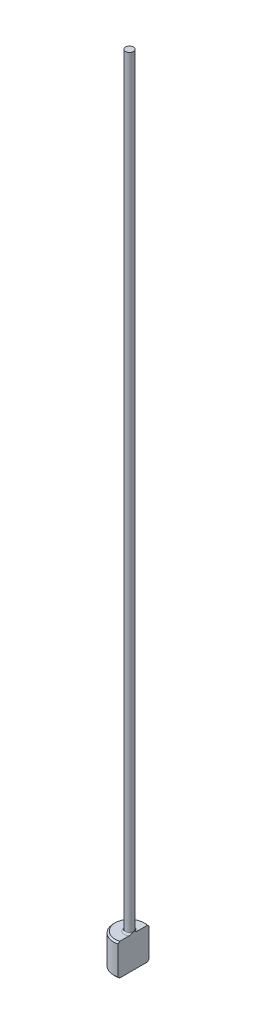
ISO-10303-21;
HEADER;
FILE_DESCRIPTION(('STEP AP214'),'2;1');
FILE_NAME('part.step','',(''),(''),'','','');
FILE_SCHEMA(('AUTOMOTIVE_DESIGN { 1 0 10303 214 1 1 1 1 }'));
ENDSEC;
DATA;
#1=APPLICATION_CONTEXT('core data for automotive mechanical design processes');
#2=APPLICATION_PROTOCOL_DEFINITION('international standard','automotive_design',2000,#1);
#3=PRODUCT_CONTEXT('',#1,'mechanical');
#4=PRODUCT('Part','Part','',(#3));
#5=PRODUCT_RELATED_PRODUCT_CATEGORY('part','',(#4));
#6=PRODUCT_DEFINITION_FORMATION('','',#4);
#7=PRODUCT_DEFINITION_CONTEXT('part definition',#1,'design');
#8=PRODUCT_DEFINITION('design','',#6,#7);
#9=PRODUCT_DEFINITION_SHAPE('','',#8);
#10=(LENGTH_UNIT() NAMED_UNIT(*) SI_UNIT(.MILLI.,.METRE.));
#11=(NAMED_UNIT(*) PLANE_ANGLE_UNIT() SI_UNIT($,.RADIAN.));
#12=(NAMED_UNIT(*) SI_UNIT($,.STERADIAN.) SOLID_ANGLE_UNIT());
#13=UNCERTAINTY_MEASURE_WITH_UNIT(LENGTH_MEASURE(1.E-05),#10,'distance_accuracy_value','');
#14=(GEOMETRIC_REPRESENTATION_CONTEXT(3) GLOBAL_UNCERTAINTY_ASSIGNED_CONTEXT((#13)) GLOBAL_UNIT_ASSIGNED_CONTEXT((#10,
#11,#12)) REPRESENTATION_CONTEXT('',''));
#15=CARTESIAN_POINT('',(0.,0.,0.));
#16=DIRECTION('',(0.,0.,1.));
#17=DIRECTION('',(1.,0.,0.));
#18=AXIS2_PLACEMENT_3D('',#15,#16,#17);
#19=CARTESIAN_POINT('',(0.,0.,0.));
#20=DIRECTION('',(0.,-1.,0.));
#21=DIRECTION('',(0.,0.,-1.));
#22=AXIS2_PLACEMENT_3D('',#19,#20,#21);
#23=PLANE('',#22);
#24=CARTESIAN_POINT('',(0.,0.,0.));
#25=DIRECTION('',(0.,-1.,0.));
#26=DIRECTION('',(0.,0.,-1.));
#27=AXIS2_PLACEMENT_3D('',#24,#25,#26);
#28=CIRCLE('',#27,1.79999999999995);
#29=CARTESIAN_POINT('',(0.499999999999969,0.,1.72916164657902));
#30=VERTEX_POINT('',#29);
#31=CARTESIAN_POINT('',(0.499999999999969,0.,-1.72916164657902));
#32=VERTEX_POINT('',#31);
#33=EDGE_CURVE('E98',#30,#32,#28,.T.);
#34=ORIENTED_EDGE('',*,*,#33,.T.);
#35=DIRECTION('',(0.,0.,1.));
#36=VECTOR('',#35,1.);
#37=CARTESIAN_POINT('',(0.499999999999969,0.,1.93649167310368));
#38=LINE('',#37,#36);
#39=EDGE_CURVE('E83',#32,#30,#38,.T.);
#40=ORIENTED_EDGE('',*,*,#39,.T.);
#41=EDGE_LOOP('',(#34,#40));
#42=FACE_BOUND('',#41,.T.);
#43=ADVANCED_FACE('F32',(#42),#23,.T.);
#44=CARTESIAN_POINT('',(0.,259.958771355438,0.));
#45=DIRECTION('',(0.,1.,0.));
#46=DIRECTION('',(0.,0.,1.));
#47=AXIS2_PLACEMENT_3D('',#44,#45,#46);
#48=CYLINDRICAL_SURFACE('',#47,1.99999999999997);
#49=CARTESIAN_POINT('',(0.,3.80000000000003,0.));
#50=DIRECTION('',(0.,1.,0.));
#51=DIRECTION('',(0.,0.,1.));
#52=AXIS2_PLACEMENT_3D('',#49,#50,#51);
#53=CIRCLE('',#52,1.99999999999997);
#54=CARTESIAN_POINT('',(0.499999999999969,3.80000000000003,1.93649167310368));
#55=VERTEX_POINT('',#54);
#56=CARTESIAN_POINT('',(0.499999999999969,3.80000000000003,-1.93649167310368));
#57=VERTEX_POINT('',#56);
#58=EDGE_CURVE('E104',#55,#57,#53,.F.);
#59=ORIENTED_EDGE('',*,*,#58,.T.);
#60=DIRECTION('',(0.,-1.,0.));
#61=VECTOR('',#60,1.);
#62=CARTESIAN_POINT('',(0.499999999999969,100.,-1.93649167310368));
#63=LINE('',#62,#61);
#64=CARTESIAN_POINT('',(0.499999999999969,0.200000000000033,-1.93649167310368));
#65=VERTEX_POINT('',#64);
#66=EDGE_CURVE('E183',#57,#65,#63,.T.);
#67=ORIENTED_EDGE('',*,*,#66,.T.);
#68=CARTESIAN_POINT('',(0.,0.200000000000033,0.));
#69=DIRECTION('',(0.,-1.,0.));
#70=DIRECTION('',(0.,0.,-1.));
#71=AXIS2_PLACEMENT_3D('',#68,#69,#70);
#72=CIRCLE('',#71,1.99999999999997);
#73=CARTESIAN_POINT('',(0.499999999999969,0.200000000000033,1.93649167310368));
#74=VERTEX_POINT('',#73);
#75=EDGE_CURVE('E100',#65,#74,#72,.F.);
#76=ORIENTED_EDGE('',*,*,#75,.T.);
#77=DIRECTION('',(0.,-1.,0.));
#78=VECTOR('',#77,1.);
#79=CARTESIAN_POINT('',(0.499999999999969,100.,1.93649167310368));
#80=LINE('',#79,#78);
#81=EDGE_CURVE('E93',#55,#74,#80,.T.);
#82=ORIENTED_EDGE('',*,*,#81,.F.);
#83=EDGE_LOOP('',(#59,#67,#76,#82));
#84=FACE_BOUND('',#83,.T.);
#85=ADVANCED_FACE('F158',(#84),#48,.T.);
#86=CARTESIAN_POINT('',(-1.99999999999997,4.,0.));
#87=DIRECTION('',(0.,1.,0.));
#88=DIRECTION('',(0.,0.,1.));
#89=AXIS2_PLACEMENT_3D('',#86,#87,#88);
#90=PLANE('',#89);
#91=CARTESIAN_POINT('',(0.,4.,0.));
#92=DIRECTION('',(0.,1.,0.));
#93=DIRECTION('',(0.,0.,1.));
#94=AXIS2_PLACEMENT_3D('',#91,#92,#93);
#95=CIRCLE('',#94,1.8);
#96=CARTESIAN_POINT('',(0.499999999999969,4.,-1.72916164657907));
#97=VERTEX_POINT('',#96);
#98=CARTESIAN_POINT('',(0.499999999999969,4.,1.72916164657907));
#99=VERTEX_POINT('',#98);
#100=EDGE_CURVE('E178',#97,#99,#95,.T.);
#101=ORIENTED_EDGE('',*,*,#100,.T.);
#102=DIRECTION('',(0.,0.,-1.));
#103=VECTOR('',#102,1.);
#104=CARTESIAN_POINT('',(0.499999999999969,4.,0.));
#105=LINE('',#104,#103);
#106=CARTESIAN_POINT('',(0.499999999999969,3.99999999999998,0.489897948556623));
#107=VERTEX_POINT('',#106);
#108=EDGE_CURVE('E57',#99,#107,#105,.T.);
#109=ORIENTED_EDGE('',*,*,#108,.T.);
#110=CARTESIAN_POINT('',(0.,4.,0.));
#111=DIRECTION('',(0.,1.,0.));
#112=DIRECTION('',(0.,0.,1.));
#113=AXIS2_PLACEMENT_3D('',#110,#111,#112);
#114=CIRCLE('',#113,0.699999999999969);
#115=CARTESIAN_POINT('',(0.499999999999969,3.99999999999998,-0.489897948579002));
#116=VERTEX_POINT('',#115);
#117=EDGE_CURVE('E107',#107,#116,#114,.F.);
#118=ORIENTED_EDGE('',*,*,#117,.T.);
#119=EDGE_CURVE('E136',#116,#97,#105,.T.);
#120=ORIENTED_EDGE('',*,*,#119,.T.);
#121=EDGE_LOOP('',(#101,#109,#118,#120));
#122=FACE_BOUND('',#121,.T.);
#123=ADVANCED_FACE('F147',(#122),#90,.T.);
#124=CARTESIAN_POINT('',(0.,4.,0.));
#125=DIRECTION('',(0.,-1.,0.));
#126=DIRECTION('',(0.,0.,-1.));
#127=AXIS2_PLACEMENT_3D('',#124,#125,#126);
#128=CONICAL_SURFACE('',#127,1.8,0.785398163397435);
#129=ORIENTED_EDGE('',*,*,#58,.F.);
#130=CARTESIAN_POINT('',(0.499999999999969,1.50720401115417,4.26357800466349));
#131=CARTESIAN_POINT('',(0.499999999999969,1.62013826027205,4.14986755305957));
#132=CARTESIAN_POINT('',(0.499999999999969,1.73304387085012,4.03612863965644));
#133=CARTESIAN_POINT('',(0.499999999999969,1.95879795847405,3.80854889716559));
#134=CARTESIAN_POINT('',(0.499999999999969,2.0716464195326,3.69470805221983));
#135=CARTESIAN_POINT('',(0.499999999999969,2.29770695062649,3.46645461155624));
#136=CARTESIAN_POINT('',(0.499999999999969,2.41091859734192,3.35204159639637));
#137=CARTESIAN_POINT('',(0.499999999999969,2.63717793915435,3.12309847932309));
#138=CARTESIAN_POINT('',(0.499999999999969,2.75022566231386,3.00856840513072));
#139=CARTESIAN_POINT('',(0.499999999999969,3.0450694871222,2.70936514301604));
#140=CARTESIAN_POINT('',(0.499999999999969,3.22671512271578,2.52454334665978));
#141=CARTESIAN_POINT('',(0.499999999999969,3.49855304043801,2.24655797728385));
#142=CARTESIAN_POINT('',(0.499999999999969,3.58909436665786,2.15373585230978));
#143=CARTESIAN_POINT('',(0.499999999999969,3.76982478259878,1.96776469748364));
#144=CARTESIAN_POINT('',(0.499999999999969,3.86001390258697,1.8746156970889));
#145=CARTESIAN_POINT('',(0.499999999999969,4.03950849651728,1.68818299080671));
#146=CARTESIAN_POINT('',(0.499999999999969,4.12881605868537,1.59490129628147));
#147=CARTESIAN_POINT('',(0.499999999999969,4.30662189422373,1.40750656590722));
#148=CARTESIAN_POINT('',(0.499999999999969,4.39511988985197,1.31339326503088));
#149=CARTESIAN_POINT('',(0.499999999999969,4.52664527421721,1.17121612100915));
#150=CARTESIAN_POINT('',(0.499999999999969,4.57025302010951,1.12368988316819));
#151=CARTESIAN_POINT('',(0.499999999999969,4.65691222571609,1.02813370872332));
#152=CARTESIAN_POINT('',(0.499999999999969,4.6999637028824,0.980103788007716));
#153=CARTESIAN_POINT('',(0.499999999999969,4.785222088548,0.883344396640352));
#154=CARTESIAN_POINT('',(0.499999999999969,4.82742943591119,0.834615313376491));
#155=CARTESIAN_POINT('',(0.499999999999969,4.9105613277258,0.736078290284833));
#156=CARTESIAN_POINT('',(0.499999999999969,4.95148615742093,0.686270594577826));
#157=CARTESIAN_POINT('',(0.499999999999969,5.00615923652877,0.616697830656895));
#158=CARTESIAN_POINT('',(0.499999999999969,5.02085639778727,0.597679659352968));
#159=CARTESIAN_POINT('',(0.499999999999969,5.04986049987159,0.559345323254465));
#160=CARTESIAN_POINT('',(0.499999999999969,5.06416741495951,0.540029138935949));
#161=CARTESIAN_POINT('',(0.499999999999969,5.09232483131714,0.500987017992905));
#162=CARTESIAN_POINT('',(0.499999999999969,5.10617402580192,0.481260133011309));
#163=CARTESIAN_POINT('',(0.499999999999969,5.1332228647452,0.441366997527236));
#164=CARTESIAN_POINT('',(0.499999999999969,5.14642252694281,0.421200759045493));
#165=CARTESIAN_POINT('',(0.499999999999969,5.18389185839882,0.361317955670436));
#166=CARTESIAN_POINT('',(0.499999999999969,5.20702995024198,0.320875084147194));
#167=CARTESIAN_POINT('',(0.499999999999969,5.24772098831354,0.237332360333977));
#168=CARTESIAN_POINT('',(0.499999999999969,5.26530335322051,0.19424799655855));
#169=CARTESIAN_POINT('',(0.499999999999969,5.28633621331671,0.120860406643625));
#170=CARTESIAN_POINT('',(0.499999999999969,5.29258236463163,0.0913941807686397));
#171=CARTESIAN_POINT('',(0.499999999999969,5.29984670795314,0.0318909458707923));
#172=CARTESIAN_POINT('',(0.499999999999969,5.30088385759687,0.00185640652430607));
#173=CARTESIAN_POINT('',(0.499999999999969,5.29754901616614,-0.0578626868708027));
#174=CARTESIAN_POINT('',(0.499999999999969,5.29318196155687,-0.0875475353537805));
#175=CARTESIAN_POINT('',(0.499999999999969,5.27991452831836,-0.145970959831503));
#176=CARTESIAN_POINT('',(0.499999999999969,5.27099331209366,-0.17470453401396));
#177=CARTESIAN_POINT('',(0.499999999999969,5.24698060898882,-0.23861617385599));
#178=CARTESIAN_POINT('',(0.499999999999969,5.23086745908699,-0.27339714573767));
#179=CARTESIAN_POINT('',(0.499999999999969,5.19533548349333,-0.341256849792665));
#180=CARTESIAN_POINT('',(0.499999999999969,5.17590893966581,-0.374331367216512));
#181=CARTESIAN_POINT('',(0.499999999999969,5.13484403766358,-0.439399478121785));
#182=CARTESIAN_POINT('',(0.499999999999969,5.11319038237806,-0.47138326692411));
#183=CARTESIAN_POINT('',(0.499999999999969,5.06854590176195,-0.534336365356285));
#184=CARTESIAN_POINT('',(0.499999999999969,5.04555662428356,-0.565306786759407));
#185=CARTESIAN_POINT('',(0.499999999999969,4.99582113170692,-0.630230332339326));
#186=CARTESIAN_POINT('',(0.499999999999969,4.96895642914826,-0.664092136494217));
#187=CARTESIAN_POINT('',(0.499999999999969,4.91443104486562,-0.731170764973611));
#188=CARTESIAN_POINT('',(0.499999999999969,4.88677027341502,-0.764387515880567));
#189=CARTESIAN_POINT('',(0.499999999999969,4.80293478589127,-0.863356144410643));
#190=CARTESIAN_POINT('',(0.499999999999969,4.74592734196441,-0.928400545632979));
#191=CARTESIAN_POINT('',(0.499999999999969,4.63061293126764,-1.05749298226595));
#192=CARTESIAN_POINT('',(0.499999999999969,4.57230411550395,-1.12153934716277));
#193=CARTESIAN_POINT('',(0.499999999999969,4.45494129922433,-1.24891760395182));
#194=CARTESIAN_POINT('',(0.499999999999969,4.39588747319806,-1.31224965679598));
#195=CARTESIAN_POINT('',(0.499999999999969,4.27755243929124,-1.43816012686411));
#196=CARTESIAN_POINT('',(0.499999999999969,4.21827347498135,-1.50074065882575));
#197=CARTESIAN_POINT('',(0.499999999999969,4.09936903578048,-1.62557837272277));
#198=CARTESIAN_POINT('',(0.499999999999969,4.0397435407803,-1.68783553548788));
#199=CARTESIAN_POINT('',(0.499999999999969,3.86059814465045,-1.87415457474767));
#200=CARTESIAN_POINT('',(0.499999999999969,3.74071340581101,-1.99786534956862));
#201=CARTESIAN_POINT('',(0.499999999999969,3.44590639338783,-2.30074922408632));
#202=CARTESIAN_POINT('',(0.499999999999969,3.27068324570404,-2.47962880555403));
#203=CARTESIAN_POINT('',(0.499999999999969,2.91959588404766,-2.83686250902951));
#204=CARTESIAN_POINT('',(0.499999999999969,2.7437314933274,-3.01521645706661));
#205=CARTESIAN_POINT('',(0.499999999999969,2.39118783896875,-3.37205745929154));
#206=CARTESIAN_POINT('',(0.499999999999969,2.21450765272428,-3.55054360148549));
#207=CARTESIAN_POINT('',(0.499999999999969,1.86097190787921,-3.90723139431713));
#208=CARTESIAN_POINT('',(0.499999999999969,1.68411642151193,-4.08543311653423));
#209=CARTESIAN_POINT('',(0.499999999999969,1.50720401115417,-4.26357800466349));
#210=B_SPLINE_CURVE_WITH_KNOTS('',3,(#130,#131,#132,#133,#134,#135,#136,#137,#138,#139,#140,
#141,#142,#143,#144,#145,#146,#147,#148,#149,#150,#151,#152,#153,#154,#155,#156,#157,#158,#159,
#160,#161,#162,#163,#164,#165,#166,#167,#168,#169,#170,#171,#172,#173,#174,#175,#176,#177,#178,
#179,#180,#181,#182,#183,#184,#185,#186,#187,#188,#189,#190,#191,#192,#193,#194,#195,#196,#197,
#198,#199,#200,#201,#202,#203,#204,#205,#206,#207,#208,#209),.UNSPECIFIED.,.F.,.F.,(4,2,2,2,2,2,
2,2,2,2,2,2,2,2,2,2,2,2,2,2,2,2,2,2,2,2,2,2,2,2,2,2,2,2,2,2,2,2,2,4),(0.,0.480788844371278,
0.961674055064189,1.44454547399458,1.92732112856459,2.70474283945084,3.09374505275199,
3.48271306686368,3.87013311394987,4.25768143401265,4.45118175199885,4.64467598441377,
4.83806685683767,5.03141440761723,5.10351649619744,5.17562332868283,5.24792081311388,
5.32021632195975,5.45980182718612,5.59863530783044,5.68861811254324,5.77827319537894,
5.8678464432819,5.95783325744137,6.0725313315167,6.18750032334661,6.30331969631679,
6.41900742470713,6.54866226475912,6.67833177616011,6.93776961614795,7.19760305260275,
7.45737672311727,7.71597304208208,7.97458452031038,8.49138885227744,9.24259169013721,
9.99402016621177,10.7474512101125,11.500646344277),.UNSPECIFIED.);
#211=EDGE_CURVE('E135',#55,#99,#210,.T.);
#212=ORIENTED_EDGE('',*,*,#211,.T.);
#213=ORIENTED_EDGE('',*,*,#100,.F.);
#214=EDGE_CURVE('E127',#97,#57,#210,.T.);
#215=ORIENTED_EDGE('',*,*,#214,.T.);
#216=EDGE_LOOP('',(#129,#212,#213,#215));
#217=FACE_BOUND('',#216,.T.);
#218=ADVANCED_FACE('F143',(#217),#128,.T.);
#219=CARTESIAN_POINT('',(0.,0.200000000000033,0.));
#220=DIRECTION('',(0.,1.,0.));
#221=DIRECTION('',(0.,0.,1.));
#222=AXIS2_PLACEMENT_3D('',#219,#220,#221);
#223=CONICAL_SURFACE('',#222,1.99999999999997,0.785398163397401);
#224=ORIENTED_EDGE('',*,*,#75,.F.);
#225=CARTESIAN_POINT('',(0.499999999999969,2.49279598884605,-4.26357800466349));
#226=CARTESIAN_POINT('',(0.499999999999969,2.37986173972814,-4.14986755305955));
#227=CARTESIAN_POINT('',(0.499999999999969,2.26695612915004,-4.0361286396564));
#228=CARTESIAN_POINT('',(0.499999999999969,2.04120204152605,-3.80854889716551));
#229=CARTESIAN_POINT('',(0.499999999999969,1.92835358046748,-3.69470805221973));
#230=CARTESIAN_POINT('',(0.499999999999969,1.70229304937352,-3.46645461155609));
#231=CARTESIAN_POINT('',(0.499999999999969,1.58908140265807,-3.3520415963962));
#232=CARTESIAN_POINT('',(0.499999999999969,1.36282206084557,-3.12309847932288));
#233=CARTESIAN_POINT('',(0.499999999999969,1.24977433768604,-3.00856840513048));
#234=CARTESIAN_POINT('',(0.499999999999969,0.954930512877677,-2.7093651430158));
#235=CARTESIAN_POINT('',(0.499999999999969,0.773284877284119,-2.52454334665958));
#236=CARTESIAN_POINT('',(0.499999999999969,0.501446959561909,-2.24655797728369));
#237=CARTESIAN_POINT('',(0.499999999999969,0.410905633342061,-2.15373585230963));
#238=CARTESIAN_POINT('',(0.499999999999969,0.23017521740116,-1.96776469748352));
#239=CARTESIAN_POINT('',(0.499999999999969,0.139986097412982,-1.87461569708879));
#240=CARTESIAN_POINT('',(0.499999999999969,-0.0395084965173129,-1.68818299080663));
#241=CARTESIAN_POINT('',(0.499999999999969,-0.128816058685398,-1.5949012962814));
#242=CARTESIAN_POINT('',(0.499999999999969,-0.30662189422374,-1.40750656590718));
#243=CARTESIAN_POINT('',(0.499999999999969,-0.395119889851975,-1.31339326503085));
#244=CARTESIAN_POINT('',(0.499999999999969,-0.52664527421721,-1.17121612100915));
#245=CARTESIAN_POINT('',(0.499999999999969,-0.570253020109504,-1.12368988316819));
#246=CARTESIAN_POINT('',(0.499999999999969,-0.656912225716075,-1.02813370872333));
#247=CARTESIAN_POINT('',(0.499999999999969,-0.699963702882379,-0.980103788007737));
#248=CARTESIAN_POINT('',(0.499999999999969,-0.785222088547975,-0.883344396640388));
#249=CARTESIAN_POINT('',(0.499999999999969,-0.827429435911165,-0.834615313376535));
#250=CARTESIAN_POINT('',(0.499999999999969,-0.910561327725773,-0.736078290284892));
#251=CARTESIAN_POINT('',(0.499999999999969,-0.951486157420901,-0.686270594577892));
#252=CARTESIAN_POINT('',(0.499999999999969,-1.00615923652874,-0.616697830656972));
#253=CARTESIAN_POINT('',(0.499999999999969,-1.02085639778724,-0.597679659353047));
#254=CARTESIAN_POINT('',(0.499999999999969,-1.04986049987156,-0.559345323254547));
#255=CARTESIAN_POINT('',(0.499999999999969,-1.06416741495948,-0.540029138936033));
#256=CARTESIAN_POINT('',(0.499999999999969,-1.09232483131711,-0.500987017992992));
#257=CARTESIAN_POINT('',(0.499999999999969,-1.10617402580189,-0.481260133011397));
#258=CARTESIAN_POINT('',(0.499999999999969,-1.13322286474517,-0.441366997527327));
#259=CARTESIAN_POINT('',(0.499999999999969,-1.14642252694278,-0.421200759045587));
#260=CARTESIAN_POINT('',(0.499999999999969,-1.1838918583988,-0.361317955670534));
#261=CARTESIAN_POINT('',(0.499999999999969,-1.20702995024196,-0.320875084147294));
#262=CARTESIAN_POINT('',(0.499999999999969,-1.24772098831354,-0.237332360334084));
#263=CARTESIAN_POINT('',(0.499999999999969,-1.26530335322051,-0.194247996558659));
#264=CARTESIAN_POINT('',(0.499999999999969,-1.28633621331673,-0.120860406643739));
#265=CARTESIAN_POINT('',(0.499999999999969,-1.29258236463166,-0.0913941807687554));
#266=CARTESIAN_POINT('',(0.499999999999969,-1.29984670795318,-0.0318909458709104));
#267=CARTESIAN_POINT('',(0.499999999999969,-1.30088385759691,-0.00185640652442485));
#268=CARTESIAN_POINT('',(0.499999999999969,-1.2975490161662,0.0578626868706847));
#269=CARTESIAN_POINT('',(0.499999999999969,-1.29318196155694,0.0875475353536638));
#270=CARTESIAN_POINT('',(0.499999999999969,-1.27991452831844,0.145970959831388));
#271=CARTESIAN_POINT('',(0.499999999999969,-1.27099331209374,0.174704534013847));
#272=CARTESIAN_POINT('',(0.499999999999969,-1.24698060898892,0.238616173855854));
#273=CARTESIAN_POINT('',(0.499999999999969,-1.23086745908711,0.27339714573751));
#274=CARTESIAN_POINT('',(0.499999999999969,-1.19533548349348,0.34125684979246));
#275=CARTESIAN_POINT('',(0.499999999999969,-1.17590893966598,0.374331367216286));
#276=CARTESIAN_POINT('',(0.499999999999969,-1.13484403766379,0.439399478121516));
#277=CARTESIAN_POINT('',(0.499999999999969,-1.11319038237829,0.47138326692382));
#278=CARTESIAN_POINT('',(0.499999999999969,-1.06854590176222,0.534336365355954));
#279=CARTESIAN_POINT('',(0.499999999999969,-1.04555662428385,0.565306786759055));
#280=CARTESIAN_POINT('',(0.499999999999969,-0.995821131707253,0.630230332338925));
#281=CARTESIAN_POINT('',(0.499999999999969,-0.968956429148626,0.664092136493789));
#282=CARTESIAN_POINT('',(0.499999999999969,-0.914431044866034,0.731170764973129));
#283=CARTESIAN_POINT('',(0.499999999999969,-0.886770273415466,0.764387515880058));
#284=CARTESIAN_POINT('',(0.499999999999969,-0.80293478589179,0.863356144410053));
#285=CARTESIAN_POINT('',(0.499999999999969,-0.745927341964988,0.928400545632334));
#286=CARTESIAN_POINT('',(0.499999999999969,-0.630612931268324,1.05749298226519));
#287=CARTESIAN_POINT('',(0.499999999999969,-0.572304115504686,1.12153934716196));
#288=CARTESIAN_POINT('',(0.499999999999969,-0.454941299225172,1.2489176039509));
#289=CARTESIAN_POINT('',(0.499999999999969,-0.395887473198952,1.31224965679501));
#290=CARTESIAN_POINT('',(0.499999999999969,-0.277552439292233,1.43816012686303));
#291=CARTESIAN_POINT('',(0.499999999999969,-0.218273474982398,1.50074065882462));
#292=CARTESIAN_POINT('',(0.499999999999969,-0.0993690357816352,1.62557837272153));
#293=CARTESIAN_POINT('',(0.499999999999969,-0.0397435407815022,1.68783553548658));
#294=CARTESIAN_POINT('',(0.499999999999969,0.139401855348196,1.87415457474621));
#295=CARTESIAN_POINT('',(0.499999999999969,0.259286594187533,1.99786534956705));
#296=CARTESIAN_POINT('',(0.499999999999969,0.554093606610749,2.30074922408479));
#297=CARTESIAN_POINT('',(0.499999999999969,0.729316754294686,2.47962880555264));
#298=CARTESIAN_POINT('',(0.499999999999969,1.08040411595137,2.8368625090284));
#299=CARTESIAN_POINT('',(0.499999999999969,1.25626850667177,3.01521645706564));
#300=CARTESIAN_POINT('',(0.499999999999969,1.60881216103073,3.37205745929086));
#301=CARTESIAN_POINT('',(0.499999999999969,1.78549234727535,3.55054360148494));
#302=CARTESIAN_POINT('',(0.499999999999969,2.13902809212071,3.90723139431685));
#303=CARTESIAN_POINT('',(0.499999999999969,2.31588357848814,4.0854331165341));
#304=CARTESIAN_POINT('',(0.499999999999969,2.49279598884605,4.26357800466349));
#305=B_SPLINE_CURVE_WITH_KNOTS('',3,(#225,#226,#227,#228,#229,#230,#231,#232,#233,#234,#235,
#236,#237,#238,#239,#240,#241,#242,#243,#244,#245,#246,#247,#248,#249,#250,#251,#252,#253,#254,
#255,#256,#257,#258,#259,#260,#261,#262,#263,#264,#265,#266,#267,#268,#269,#270,#271,#272,#273,
#274,#275,#276,#277,#278,#279,#280,#281,#282,#283,#284,#285,#286,#287,#288,#289,#290,#291,#292,
#293,#294,#295,#296,#297,#298,#299,#300,#301,#302,#303,#304),.UNSPECIFIED.,.F.,.F.,(4,2,2,2,2,2,
2,2,2,2,2,2,2,2,2,2,2,2,2,2,2,2,2,2,2,2,2,2,2,2,2,2,2,2,2,2,2,2,2,4),(0.,0.480788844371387,
0.961674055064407,1.44454547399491,1.92732112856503,2.70474283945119,3.09374505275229,
3.48271306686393,3.87013311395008,4.25768143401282,4.45118175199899,4.64467598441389,
4.83806685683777,5.03141440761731,5.10351649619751,5.17562332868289,5.24792081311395,
5.32021632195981,5.45980182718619,5.5986353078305,5.6886181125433,5.778273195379,
5.86784644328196,5.95783325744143,6.07253133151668,6.1875003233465,6.30331969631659,
6.41900742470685,6.54866226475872,6.6783317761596,6.93776961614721,7.19760305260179,
7.45737672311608,7.71597304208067,7.97458452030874,8.49138885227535,9.24259169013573,
9.99402016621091,10.7474512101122,11.5006463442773),.UNSPECIFIED.);
#306=EDGE_CURVE('E86',#65,#32,#305,.T.);
#307=ORIENTED_EDGE('',*,*,#306,.T.);
#308=ORIENTED_EDGE('',*,*,#33,.F.);
#309=EDGE_CURVE('E89',#30,#74,#305,.T.);
#310=ORIENTED_EDGE('',*,*,#309,.T.);
#311=EDGE_LOOP('',(#224,#307,#308,#310));
#312=FACE_BOUND('',#311,.T.);
#313=ADVANCED_FACE('F97',(#312),#223,.T.);
#314=CARTESIAN_POINT('',(0.,4.19999999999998,0.));
#315=DIRECTION('',(0.,1.,0.));
#316=DIRECTION('',(0.,0.,1.));
#317=AXIS2_PLACEMENT_3D('',#314,#315,#316);
#318=TOROIDAL_SURFACE('',#317,0.699999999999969,0.2);
#319=CARTESIAN_POINT('',(0.499999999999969,4.19999999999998,0.));
#320=CARTESIAN_POINT('',(0.499999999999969,4.20000053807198,-1.27629116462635E-10));
#321=CARTESIAN_POINT('',(0.499999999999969,4.20000107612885,-6.32255682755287E-08));
#322=CARTESIAN_POINT('',(0.499999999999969,4.20000213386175,-2.82964879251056E-07));
#323=CARTESIAN_POINT('',(0.499999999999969,4.2000026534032,-4.40183617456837E-07));
#324=CARTESIAN_POINT('',(0.499999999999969,4.2000036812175,-8.27813239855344E-07));
#325=CARTESIAN_POINT('',(0.499999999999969,4.20000418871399,-1.06023394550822E-06));
#326=CARTESIAN_POINT('',(0.499999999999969,4.20000517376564,-1.57839954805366E-06));
#327=CARTESIAN_POINT('',(0.499999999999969,4.20000565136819,-1.86405706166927E-06));
#328=CARTESIAN_POINT('',(0.499999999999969,4.20000714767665,-2.84099907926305E-06));
#329=CARTESIAN_POINT('',(0.499999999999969,4.20000811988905,-3.60394456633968E-06));
#330=CARTESIAN_POINT('',(0.499999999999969,4.20000994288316,-5.23848834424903E-06));
#331=CARTESIAN_POINT('',(0.499999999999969,4.2000107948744,-6.1088098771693E-06));
#332=CARTESIAN_POINT('',(0.499999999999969,4.20001370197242,-9.26870442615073E-06));
#333=CARTESIAN_POINT('',(0.499999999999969,4.20001560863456,-1.16970153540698E-05));
#334=CARTESIAN_POINT('',(0.499999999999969,4.20001898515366,-1.66756205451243E-05));
#335=CARTESIAN_POINT('',(0.499999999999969,4.20002047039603,-1.92160230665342E-05));
#336=CARTESIAN_POINT('',(0.499999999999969,4.20002619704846,-2.92662000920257E-05));
#337=CARTESIAN_POINT('',(0.499999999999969,4.20003022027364,-3.68956532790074E-05));
#338=CARTESIAN_POINT('',(0.499999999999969,4.20003721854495,-5.16224753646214E-05));
#339=CARTESIAN_POINT('',(0.499999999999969,4.20004025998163,-5.86875950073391E-05));
#340=CARTESIAN_POINT('',(0.499999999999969,4.20006250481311,-0.000106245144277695));
#341=CARTESIAN_POINT('',(0.499999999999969,4.20008869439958,-0.000143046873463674));
#342=CARTESIAN_POINT('',(0.499999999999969,4.20018287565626,-0.000281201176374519));
#343=CARTESIAN_POINT('',(0.499999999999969,4.20024565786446,-0.000385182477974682));
#344=CARTESIAN_POINT('',(0.499999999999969,4.20048281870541,-0.000771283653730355));
#345=CARTESIAN_POINT('',(0.499999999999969,4.20066255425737,-0.00105071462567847));
#346=CARTESIAN_POINT('',(0.499999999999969,4.2013621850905,-0.0021447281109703));
#347=CARTESIAN_POINT('',(0.499999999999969,4.20187621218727,-0.00296224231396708));
#348=CARTESIAN_POINT('',(0.499999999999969,4.2120449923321,-0.0191275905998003));
#349=CARTESIAN_POINT('',(0.499999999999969,4.22176135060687,-0.0344456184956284));
#350=CARTESIAN_POINT('',(0.499999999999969,4.24070578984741,-0.064750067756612));
#351=CARTESIAN_POINT('',(0.499999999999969,4.24993981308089,-0.0797328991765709));
#352=CARTESIAN_POINT('',(0.499999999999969,4.26897796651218,-0.11131272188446));
#353=CARTESIAN_POINT('',(0.499999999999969,4.27875278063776,-0.127927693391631));
#354=CARTESIAN_POINT('',(0.499999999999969,4.29780667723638,-0.161620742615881));
#355=CARTESIAN_POINT('',(0.499999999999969,4.30708102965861,-0.178701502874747));
#356=CARTESIAN_POINT('',(0.499999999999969,4.32980242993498,-0.222999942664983));
#357=CARTESIAN_POINT('',(0.499999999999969,4.34266834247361,-0.250524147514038));
#358=CARTESIAN_POINT('',(0.499999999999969,4.36514581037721,-0.306264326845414));
#359=CARTESIAN_POINT('',(0.499999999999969,4.37481868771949,-0.334454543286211));
#360=CARTESIAN_POINT('',(0.499999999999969,4.38854584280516,-0.386409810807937));
#361=CARTESIAN_POINT('',(0.499999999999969,4.39332419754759,-0.409978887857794));
#362=CARTESIAN_POINT('',(0.499999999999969,4.39948103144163,-0.458484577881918));
#363=CARTESIAN_POINT('',(0.499999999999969,4.40073041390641,-0.483439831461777));
#364=CARTESIAN_POINT('',(0.499999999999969,4.39878549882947,-0.525361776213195));
#365=CARTESIAN_POINT('',(0.499999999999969,4.39685919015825,-0.542385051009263));
#366=CARTESIAN_POINT('',(0.499999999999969,4.39040994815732,-0.575800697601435));
#367=CARTESIAN_POINT('',(0.499999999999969,4.38591117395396,-0.592197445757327));
#368=CARTESIAN_POINT('',(0.499999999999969,4.37526817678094,-0.620627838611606));
#369=CARTESIAN_POINT('',(0.499999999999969,4.36965917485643,-0.632860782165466));
#370=CARTESIAN_POINT('',(0.499999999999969,4.35652191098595,-0.656281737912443));
#371=CARTESIAN_POINT('',(0.499999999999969,4.34899258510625,-0.667469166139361));
#372=CARTESIAN_POINT('',(0.499999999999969,4.33348787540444,-0.686489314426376));
#373=CARTESIAN_POINT('',(0.499999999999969,4.32581455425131,-0.694567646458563));
#374=CARTESIAN_POINT('',(0.499999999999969,4.3092359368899,-0.709348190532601));
#375=CARTESIAN_POINT('',(0.499999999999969,4.30033137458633,-0.716051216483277));
#376=CARTESIAN_POINT('',(0.499999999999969,4.28139900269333,-0.727801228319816));
#377=CARTESIAN_POINT('',(0.499999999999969,4.27136420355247,-0.732837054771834));
#378=CARTESIAN_POINT('',(0.499999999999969,4.25051406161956,-0.740896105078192));
#379=CARTESIAN_POINT('',(0.499999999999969,4.2396991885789,-0.743920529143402));
#380=CARTESIAN_POINT('',(0.499999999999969,4.2189584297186,-0.747541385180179));
#381=CARTESIAN_POINT('',(0.499999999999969,4.2090739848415,-0.748377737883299));
#382=CARTESIAN_POINT('',(0.499999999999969,4.18931562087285,-0.748281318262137));
#383=CARTESIAN_POINT('',(0.499999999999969,4.17944169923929,-0.747349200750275));
#384=CARTESIAN_POINT('',(0.499999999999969,4.16050847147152,-0.743859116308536));
#385=CARTESIAN_POINT('',(0.499999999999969,4.15143326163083,-0.741386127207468));
#386=CARTESIAN_POINT('',(0.499999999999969,4.13380308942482,-0.735008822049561));
#387=CARTESIAN_POINT('',(0.499999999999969,4.12524816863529,-0.731104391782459));
#388=CARTESIAN_POINT('',(0.499999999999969,4.10851288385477,-0.721844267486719));
#389=CARTESIAN_POINT('',(0.499999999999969,4.10036152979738,-0.716436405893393));
#390=CARTESIAN_POINT('',(0.499999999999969,4.08496509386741,-0.704462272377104));
#391=CARTESIAN_POINT('',(0.499999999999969,4.07772021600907,-0.697895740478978));
#392=CARTESIAN_POINT('',(0.499999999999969,4.06343918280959,-0.683009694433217));
#393=CARTESIAN_POINT('',(0.499999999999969,4.05652301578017,-0.674575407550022));
#394=CARTESIAN_POINT('',(0.499999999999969,4.04395017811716,-0.656812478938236));
#395=CARTESIAN_POINT('',(0.499999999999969,4.03829500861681,-0.64748278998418));
#396=CARTESIAN_POINT('',(0.499999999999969,4.02585782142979,-0.623622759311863));
#397=CARTESIAN_POINT('',(0.499999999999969,4.01980001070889,-0.608712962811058));
#398=CARTESIAN_POINT('',(0.499999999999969,4.01019798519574,-0.578151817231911));
#399=CARTESIAN_POINT('',(0.499999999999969,4.00665175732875,-0.562501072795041));
#400=CARTESIAN_POINT('',(0.499999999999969,4.00085035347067,-0.524814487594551));
#401=CARTESIAN_POINT('',(0.499999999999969,3.99960660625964,-0.502624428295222));
#402=CARTESIAN_POINT('',(0.499999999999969,4.00061484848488,-0.458055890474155));
#403=CARTESIAN_POINT('',(0.499999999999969,4.00291806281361,-0.435679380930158));
#404=CARTESIAN_POINT('',(0.499999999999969,4.01287206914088,-0.376621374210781));
#405=CARTESIAN_POINT('',(0.499999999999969,4.02306808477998,-0.340374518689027));
#406=CARTESIAN_POINT('',(0.499999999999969,4.04187976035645,-0.288479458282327));
#407=CARTESIAN_POINT('',(0.499999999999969,4.04850685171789,-0.272022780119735));
#408=CARTESIAN_POINT('',(0.499999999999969,4.06265559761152,-0.239604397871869));
#409=CARTESIAN_POINT('',(0.499999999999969,4.07017183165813,-0.223640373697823));
#410=CARTESIAN_POINT('',(0.499999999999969,4.08582562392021,-0.192266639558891));
#411=CARTESIAN_POINT('',(0.499999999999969,4.0939546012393,-0.176852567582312));
#412=CARTESIAN_POINT('',(0.499999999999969,4.1109061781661,-0.146010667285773));
#413=CARTESIAN_POINT('',(0.499999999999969,4.11973937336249,-0.130588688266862));
#414=CARTESIAN_POINT('',(0.499999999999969,4.13454771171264,-0.105462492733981));
#415=CARTESIAN_POINT('',(0.499999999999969,4.14041135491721,-0.0956918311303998));
#416=CARTESIAN_POINT('',(0.499999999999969,4.15220833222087,-0.0762990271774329));
#417=CARTESIAN_POINT('',(0.499999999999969,4.15814073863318,-0.0666763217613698));
#418=CARTESIAN_POINT('',(0.499999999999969,4.16956358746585,-0.048295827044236));
#419=CARTESIAN_POINT('',(0.499999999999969,4.17504841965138,-0.0395344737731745));
#420=CARTESIAN_POINT('',(0.499999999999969,4.18623643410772,-0.0217806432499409));
#421=CARTESIAN_POINT('',(0.499999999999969,4.19194123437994,-0.0127891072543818));
#422=CARTESIAN_POINT('',(0.499999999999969,4.19812331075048,-0.00296314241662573));
#423=CARTESIAN_POINT('',(0.499999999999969,4.19863673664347,-0.0021464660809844));
#424=CARTESIAN_POINT('',(0.499999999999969,4.19933619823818,-0.00105268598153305));
#425=CARTESIAN_POINT('',(0.499999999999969,4.19951633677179,-0.000772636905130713));
#426=CARTESIAN_POINT('',(0.499999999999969,4.19975399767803,-0.000385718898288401));
#427=CARTESIAN_POINT('',(0.499999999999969,4.19981689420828,-0.000281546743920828));
#428=CARTESIAN_POINT('',(0.499999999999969,4.19991123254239,-0.000143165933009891));
#429=CARTESIAN_POINT('',(0.499999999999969,4.19993745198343,-0.000106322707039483));
#430=CARTESIAN_POINT('',(0.499999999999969,4.19995971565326,-5.87132323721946E-05));
#431=CARTESIAN_POINT('',(0.499999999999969,4.19996275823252,-5.16436190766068E-05));
#432=CARTESIAN_POINT('',(0.499999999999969,4.19996976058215,-3.69075222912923E-05));
#433=CARTESIAN_POINT('',(0.499999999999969,4.19997378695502,-2.92733863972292E-05));
#434=CARTESIAN_POINT('',(0.499999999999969,4.19997951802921,-1.92179207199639E-05));
#435=CARTESIAN_POINT('',(0.499999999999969,4.19998100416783,-1.66766583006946E-05));
#436=CARTESIAN_POINT('',(0.499999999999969,4.19998438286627,-1.16965321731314E-05));
#437=CARTESIAN_POINT('',(0.499999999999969,4.19998629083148,-9.26757624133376E-06));
#438=CARTESIAN_POINT('',(0.499999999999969,4.19998919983,-6.10711790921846E-06));
#439=CARTESIAN_POINT('',(0.499999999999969,4.19999005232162,-5.23671652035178E-06));
#440=CARTESIAN_POINT('',(0.499999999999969,4.19999187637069,-3.60211739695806E-06));
#441=CARTESIAN_POINT('',(0.499999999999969,4.1999928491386,-2.83919806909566E-06));
#442=CARTESIAN_POINT('',(0.499999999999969,4.19999434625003,-1.86241401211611E-06));
#443=CARTESIAN_POINT('',(0.499999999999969,4.19999482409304,-1.57682668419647E-06));
#444=CARTESIAN_POINT('',(0.499999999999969,4.19999580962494,-1.05884216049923E-06));
#445=CARTESIAN_POINT('',(0.499999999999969,4.19999631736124,-8.26532461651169E-07));
#446=CARTESIAN_POINT('',(0.499999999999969,4.19999734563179,-4.39174206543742E-07));
#447=CARTESIAN_POINT('',(0.499999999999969,4.19999786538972,-2.82113668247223E-07));
#448=CARTESIAN_POINT('',(0.499999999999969,4.19999892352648,-6.27517719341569E-08));
#449=CARTESIAN_POINT('',(0.499999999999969,4.1999994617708,1.27666399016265E-10));
#450=CARTESIAN_POINT('',(0.499999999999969,4.19999999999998,0.));
#451=B_SPLINE_CURVE_WITH_KNOTS('',3,(#319,#320,#321,#322,#323,#324,#325,#326,#327,#328,#329,
#330,#331,#332,#333,#334,#335,#336,#337,#338,#339,#340,#341,#342,#343,#344,#345,#346,#347,#348,
#349,#350,#351,#352,#353,#354,#355,#356,#357,#358,#359,#360,#361,#362,#363,#364,#365,#366,#367,
#368,#369,#370,#371,#372,#373,#374,#375,#376,#377,#378,#379,#380,#381,#382,#383,#384,#385,#386,
#387,#388,#389,#390,#391,#392,#393,#394,#395,#396,#397,#398,#399,#400,#401,#402,#403,#404,#405,
#406,#407,#408,#409,#410,#411,#412,#413,#414,#415,#416,#417,#418,#419,#420,#421,#422,#423,#424,
#425,#426,#427,#428,#429,#430,#431,#432,#433,#434,#435,#436,#437,#438,#439,#440,#441,#442,#443,
#444,#445,#446,#447,#448,#449,#450),.UNSPECIFIED.,.T.,.F.,(4,2,2,2,2,2,2,2,2,2,2,2,2,2,2,2,2,2,
2,2,2,2,2,2,2,2,2,2,2,2,2,2,2,2,2,2,2,2,2,2,2,2,2,2,2,2,2,2,2,2,2,2,2,2,2,2,2,2,2,2,2,2,2,2,2,
4),(0.,1.61264141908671E-06,3.23527813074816E-06,4.90546475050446E-06,6.57293368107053E-06,
1.0263372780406E-05,1.3913533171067E-05,2.31348502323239E-05,3.19553030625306E-05,
5.78146512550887E-05,8.08644760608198E-05,0.000215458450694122,0.000580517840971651,
0.00157645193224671,0.0044742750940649,0.0588833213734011,0.111683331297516,0.169505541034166,
0.227802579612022,0.318834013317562,0.407998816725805,0.479955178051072,0.55451173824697,
0.605741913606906,0.656498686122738,0.696722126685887,0.736967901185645,0.770257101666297,
0.803526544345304,0.837014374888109,0.87048220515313,0.90008770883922,0.929682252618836,
0.957773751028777,0.985867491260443,1.0150939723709,1.04432701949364,1.07692454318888,
1.10956066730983,1.15757154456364,1.20554389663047,1.27185088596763,1.33912449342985,
1.45136032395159,1.50457430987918,1.55747915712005,1.6097463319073,1.66305527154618,
1.69723993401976,1.73115218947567,1.76216312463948,1.79410330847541,1.79699806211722,
1.79799620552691,1.79836193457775,1.79849668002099,1.79851974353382,1.79854561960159,
1.79855444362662,1.79856366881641,1.79856732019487,1.79857101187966,1.79857267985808,
1.79857435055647,1.79857597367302,1.79857758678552),.UNSPECIFIED.);
#452=CARTESIAN_POINT('',(0.499999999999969,4.19999999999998,0.));
#453=VERTEX_POINT('',#452);
#454=EDGE_CURVE('E11',#116,#453,#451,.T.);
#455=ORIENTED_EDGE('',*,*,#454,.F.);
#456=ORIENTED_EDGE('',*,*,#117,.F.);
#457=CARTESIAN_POINT('',(0.499999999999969,4.19999999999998,0.));
#458=CARTESIAN_POINT('',(0.499999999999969,4.19999946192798,1.27629279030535E-10));
#459=CARTESIAN_POINT('',(0.499999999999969,4.19999892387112,6.32255684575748E-08));
#460=CARTESIAN_POINT('',(0.499999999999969,4.19999786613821,2.82964879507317E-07));
#461=CARTESIAN_POINT('',(0.499999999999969,4.19999734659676,4.40183617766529E-07));
#462=CARTESIAN_POINT('',(0.499999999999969,4.19999631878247,8.27813240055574E-07));
#463=CARTESIAN_POINT('',(0.499999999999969,4.19999581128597,1.06023394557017E-06));
#464=CARTESIAN_POINT('',(0.499999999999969,4.19999482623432,1.5783995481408E-06));
#465=CARTESIAN_POINT('',(0.499999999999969,4.19999434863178,1.86405706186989E-06));
#466=CARTESIAN_POINT('',(0.499999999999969,4.19999285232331,2.84099907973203E-06));
#467=CARTESIAN_POINT('',(0.499999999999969,4.19999188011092,3.60394456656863E-06));
#468=CARTESIAN_POINT('',(0.499999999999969,4.19999005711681,5.2384883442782E-06));
#469=CARTESIAN_POINT('',(0.499999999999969,4.19998920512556,6.10880987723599E-06));
#470=CARTESIAN_POINT('',(0.499999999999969,4.19998629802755,9.26870442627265E-06));
#471=CARTESIAN_POINT('',(0.499999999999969,4.1999843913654,1.16970153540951E-05));
#472=CARTESIAN_POINT('',(0.499999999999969,4.1999810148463,1.6675620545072E-05));
#473=CARTESIAN_POINT('',(0.499999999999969,4.19997952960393,1.92160230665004E-05));
#474=CARTESIAN_POINT('',(0.499999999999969,4.19997380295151,2.92662000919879E-05));
#475=CARTESIAN_POINT('',(0.499999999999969,4.19996977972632,3.6895653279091E-05));
#476=CARTESIAN_POINT('',(0.499999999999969,4.19996278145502,5.16224753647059E-05));
#477=CARTESIAN_POINT('',(0.499999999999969,4.19995974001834,5.86875950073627E-05));
#478=CARTESIAN_POINT('',(0.499999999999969,4.19993749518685,0.000106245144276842));
#479=CARTESIAN_POINT('',(0.499999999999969,4.19991130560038,0.000143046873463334));
#480=CARTESIAN_POINT('',(0.499999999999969,4.1998171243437,0.000281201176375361));
#481=CARTESIAN_POINT('',(0.499999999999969,4.19975434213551,0.000385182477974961));
#482=CARTESIAN_POINT('',(0.499999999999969,4.19951718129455,0.000771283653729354));
#483=CARTESIAN_POINT('',(0.499999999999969,4.19933744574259,0.00105071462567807));
#484=CARTESIAN_POINT('',(0.499999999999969,4.19863781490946,0.00214472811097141));
#485=CARTESIAN_POINT('',(0.499999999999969,4.19812378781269,0.00296224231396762));
#486=CARTESIAN_POINT('',(0.499999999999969,4.18795500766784,0.0191275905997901));
#487=CARTESIAN_POINT('',(0.499999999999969,4.17823864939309,0.0344456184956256));
#488=CARTESIAN_POINT('',(0.499999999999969,4.15929421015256,0.0647500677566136));
#489=CARTESIAN_POINT('',(0.499999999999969,4.15006018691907,0.0797328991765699));
#490=CARTESIAN_POINT('',(0.499999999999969,4.13102203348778,0.111312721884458));
#491=CARTESIAN_POINT('',(0.499999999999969,4.12124721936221,0.127927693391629));
#492=CARTESIAN_POINT('',(0.499999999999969,4.10219332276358,0.161620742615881));
#493=CARTESIAN_POINT('',(0.499999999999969,4.09291897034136,0.178701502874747));
#494=CARTESIAN_POINT('',(0.499999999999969,4.07019757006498,0.222999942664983));
#495=CARTESIAN_POINT('',(0.499999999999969,4.05733165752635,0.250524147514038));
#496=CARTESIAN_POINT('',(0.499999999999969,4.03485418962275,0.306264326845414));
#497=CARTESIAN_POINT('',(0.499999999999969,4.02518131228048,0.334454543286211));
#498=CARTESIAN_POINT('',(0.499999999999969,4.0114541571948,0.386409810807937));
#499=CARTESIAN_POINT('',(0.499999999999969,4.00667580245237,0.409978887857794));
#500=CARTESIAN_POINT('',(0.499999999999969,4.00051896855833,0.458484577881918));
#501=CARTESIAN_POINT('',(0.499999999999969,3.99926958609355,0.483439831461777));
#502=CARTESIAN_POINT('',(0.499999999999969,4.0012145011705,0.525361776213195));
#503=CARTESIAN_POINT('',(0.499999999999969,4.00314080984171,0.542385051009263));
#504=CARTESIAN_POINT('',(0.499999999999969,4.00959005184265,0.575800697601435));
#505=CARTESIAN_POINT('',(0.499999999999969,4.014088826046,0.592197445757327));
#506=CARTESIAN_POINT('',(0.499999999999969,4.02473182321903,0.620627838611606));
#507=CARTESIAN_POINT('',(0.499999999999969,4.03034082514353,0.632860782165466));
#508=CARTESIAN_POINT('',(0.499999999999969,4.04347808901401,0.656281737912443));
#509=CARTESIAN_POINT('',(0.499999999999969,4.05100741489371,0.667469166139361));
#510=CARTESIAN_POINT('',(0.499999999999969,4.06651212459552,0.686489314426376));
#511=CARTESIAN_POINT('',(0.499999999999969,4.07418544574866,0.694567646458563));
#512=CARTESIAN_POINT('',(0.499999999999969,4.09076406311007,0.709348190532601));
#513=CARTESIAN_POINT('',(0.499999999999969,4.09966862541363,0.716051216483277));
#514=CARTESIAN_POINT('',(0.499999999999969,4.11860099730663,0.727801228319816));
#515=CARTESIAN_POINT('',(0.499999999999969,4.12863579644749,0.732837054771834));
#516=CARTESIAN_POINT('',(0.499999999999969,4.14948593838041,0.740896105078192));
#517=CARTESIAN_POINT('',(0.499999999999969,4.16030081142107,0.743920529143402));
#518=CARTESIAN_POINT('',(0.499999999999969,4.18104157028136,0.747541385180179));
#519=CARTESIAN_POINT('',(0.499999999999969,4.19092601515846,0.748377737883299));
#520=CARTESIAN_POINT('',(0.499999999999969,4.21068437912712,0.748281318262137));
#521=CARTESIAN_POINT('',(0.499999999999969,4.22055830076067,0.747349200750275));
#522=CARTESIAN_POINT('',(0.499999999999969,4.23949152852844,0.743859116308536));
#523=CARTESIAN_POINT('',(0.499999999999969,4.24856673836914,0.741386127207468));
#524=CARTESIAN_POINT('',(0.499999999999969,4.26619691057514,0.735008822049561));
#525=CARTESIAN_POINT('',(0.499999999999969,4.27475183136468,0.731104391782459));
#526=CARTESIAN_POINT('',(0.499999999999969,4.29148711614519,0.721844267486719));
#527=CARTESIAN_POINT('',(0.499999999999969,4.29963847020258,0.716436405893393));
#528=CARTESIAN_POINT('',(0.499999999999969,4.31503490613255,0.704462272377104));
#529=CARTESIAN_POINT('',(0.499999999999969,4.3222797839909,0.697895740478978));
#530=CARTESIAN_POINT('',(0.499999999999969,4.33656081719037,0.683009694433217));
#531=CARTESIAN_POINT('',(0.499999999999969,4.34347698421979,0.674575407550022));
#532=CARTESIAN_POINT('',(0.499999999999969,4.3560498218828,0.656812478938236));
#533=CARTESIAN_POINT('',(0.499999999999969,4.36170499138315,0.64748278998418));
#534=CARTESIAN_POINT('',(0.499999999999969,4.37414217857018,0.623622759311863));
#535=CARTESIAN_POINT('',(0.499999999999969,4.38019998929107,0.608712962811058));
#536=CARTESIAN_POINT('',(0.499999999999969,4.38980201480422,0.57815181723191));
#537=CARTESIAN_POINT('',(0.499999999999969,4.39334824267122,0.562501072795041));
#538=CARTESIAN_POINT('',(0.499999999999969,4.39914964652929,0.524814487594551));
#539=CARTESIAN_POINT('',(0.499999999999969,4.40039339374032,0.502624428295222));
#540=CARTESIAN_POINT('',(0.499999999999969,4.39938515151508,0.458055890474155));
#541=CARTESIAN_POINT('',(0.499999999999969,4.39708193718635,0.435679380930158));
#542=CARTESIAN_POINT('',(0.499999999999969,4.38712793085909,0.376621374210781));
#543=CARTESIAN_POINT('',(0.499999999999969,4.37693191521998,0.340374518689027));
#544=CARTESIAN_POINT('',(0.499999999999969,4.35812023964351,0.288479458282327));
#545=CARTESIAN_POINT('',(0.499999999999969,4.35149314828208,0.272022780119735));
#546=CARTESIAN_POINT('',(0.499999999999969,4.33734440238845,0.239604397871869));
#547=CARTESIAN_POINT('',(0.499999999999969,4.32982816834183,0.223640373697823));
#548=CARTESIAN_POINT('',(0.499999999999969,4.31417437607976,0.192266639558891));
#549=CARTESIAN_POINT('',(0.499999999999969,4.30604539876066,0.176852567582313));
#550=CARTESIAN_POINT('',(0.499999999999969,4.28909382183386,0.146010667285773));
#551=CARTESIAN_POINT('',(0.499999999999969,4.28026062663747,0.130588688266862));
#552=CARTESIAN_POINT('',(0.499999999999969,4.26545228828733,0.105462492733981));
#553=CARTESIAN_POINT('',(0.499999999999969,4.25958864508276,0.0956918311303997));
#554=CARTESIAN_POINT('',(0.499999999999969,4.24779166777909,0.0762990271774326));
#555=CARTESIAN_POINT('',(0.499999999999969,4.24185926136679,0.0666763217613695));
#556=CARTESIAN_POINT('',(0.499999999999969,4.23043641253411,0.0482958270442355));
#557=CARTESIAN_POINT('',(0.499999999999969,4.22495158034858,0.0395344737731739));
#558=CARTESIAN_POINT('',(0.499999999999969,4.21376356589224,0.0217806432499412));
#559=CARTESIAN_POINT('',(0.499999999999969,4.20805876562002,0.0127891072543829));
#560=CARTESIAN_POINT('',(0.499999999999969,4.20187668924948,0.00296314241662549));
#561=CARTESIAN_POINT('',(0.499999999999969,4.20136326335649,0.0021464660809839));
#562=CARTESIAN_POINT('',(0.499999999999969,4.20066380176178,0.00105268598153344));
#563=CARTESIAN_POINT('',(0.499999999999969,4.20048366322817,0.000772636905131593));
#564=CARTESIAN_POINT('',(0.499999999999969,4.20024600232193,0.000385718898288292));
#565=CARTESIAN_POINT('',(0.499999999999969,4.20018310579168,0.000281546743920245));
#566=CARTESIAN_POINT('',(0.499999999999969,4.20008876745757,0.000143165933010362));
#567=CARTESIAN_POINT('',(0.499999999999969,4.20006254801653,0.000106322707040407));
#568=CARTESIAN_POINT('',(0.499999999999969,4.2000402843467,5.87132323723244E-05));
#569=CARTESIAN_POINT('',(0.499999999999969,4.20003724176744,5.16436190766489E-05));
#570=CARTESIAN_POINT('',(0.499999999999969,4.20003023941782,3.69075222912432E-05));
#571=CARTESIAN_POINT('',(0.499999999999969,4.20002621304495,2.92733863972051E-05));
#572=CARTESIAN_POINT('',(0.499999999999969,4.20002048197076,1.92179207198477E-05));
#573=CARTESIAN_POINT('',(0.499999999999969,4.20001899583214,1.66766583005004E-05));
#574=CARTESIAN_POINT('',(0.499999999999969,4.2000156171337,1.16965321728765E-05));
#575=CARTESIAN_POINT('',(0.499999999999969,4.20001370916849,9.26757624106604E-06));
#576=CARTESIAN_POINT('',(0.499999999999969,4.20001080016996,6.10711790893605E-06));
#577=CARTESIAN_POINT('',(0.499999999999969,4.20000994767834,5.23671652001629E-06));
#578=CARTESIAN_POINT('',(0.499999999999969,4.20000812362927,3.60211739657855E-06));
#579=CARTESIAN_POINT('',(0.499999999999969,4.20000715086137,2.83919806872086E-06));
#580=CARTESIAN_POINT('',(0.499999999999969,4.20000565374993,1.8624140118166E-06));
#581=CARTESIAN_POINT('',(0.499999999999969,4.20000517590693,1.57682668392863E-06));
#582=CARTESIAN_POINT('',(0.499999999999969,4.20000419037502,1.05884216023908E-06));
#583=CARTESIAN_POINT('',(0.499999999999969,4.20000368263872,8.26532461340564E-07));
#584=CARTESIAN_POINT('',(0.499999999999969,4.20000265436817,4.39174206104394E-07));
#585=CARTESIAN_POINT('',(0.499999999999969,4.20000213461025,2.82113667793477E-07));
#586=CARTESIAN_POINT('',(0.499999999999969,4.20000107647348,6.27517715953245E-08));
#587=CARTESIAN_POINT('',(0.499999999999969,4.20000053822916,-1.27666561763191E-10));
#588=CARTESIAN_POINT('',(0.499999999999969,4.19999999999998,0.));
#589=B_SPLINE_CURVE_WITH_KNOTS('',3,(#457,#458,#459,#460,#461,#462,#463,#464,#465,#466,#467,
#468,#469,#470,#471,#472,#473,#474,#475,#476,#477,#478,#479,#480,#481,#482,#483,#484,#485,#486,
#487,#488,#489,#490,#491,#492,#493,#494,#495,#496,#497,#498,#499,#500,#501,#502,#503,#504,#505,
#506,#507,#508,#509,#510,#511,#512,#513,#514,#515,#516,#517,#518,#519,#520,#521,#522,#523,#524,
#525,#526,#527,#528,#529,#530,#531,#532,#533,#534,#535,#536,#537,#538,#539,#540,#541,#542,#543,
#544,#545,#546,#547,#548,#549,#550,#551,#552,#553,#554,#555,#556,#557,#558,#559,#560,#561,#562,
#563,#564,#565,#566,#567,#568,#569,#570,#571,#572,#573,#574,#575,#576,#577,#578,#579,#580,#581,
#582,#583,#584,#585,#586,#587,#588),.UNSPECIFIED.,.T.,.F.,(4,2,2,2,2,2,2,2,2,2,2,2,2,2,2,2,2,2,
2,2,2,2,2,2,2,2,2,2,2,2,2,2,2,2,2,2,2,2,2,2,2,2,2,2,2,2,2,2,2,2,2,2,2,2,2,2,2,2,2,2,2,2,2,2,2,
4),(0.,1.61264141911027E-06,3.23527813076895E-06,4.90546475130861E-06,6.57293368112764E-06,
1.02633727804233E-05,1.39135331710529E-05,2.31348502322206E-05,3.19553030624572E-05,
5.78146512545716E-05,8.08644760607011E-05,0.000215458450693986,0.000580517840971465,
0.00157645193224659,0.00447427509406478,0.0588833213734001,0.111683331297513,0.169505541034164,
0.227802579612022,0.318834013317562,0.407998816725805,0.479955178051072,0.55451173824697,
0.605741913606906,0.656498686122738,0.696722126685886,0.736967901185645,0.770257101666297,
0.803526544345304,0.837014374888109,0.87048220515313,0.90008770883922,0.929682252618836,
0.957773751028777,0.985867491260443,1.0150939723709,1.04432701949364,1.07692454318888,
1.10956066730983,1.15757154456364,1.20554389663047,1.27185088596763,1.33912449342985,
1.45136032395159,1.50457430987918,1.55747915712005,1.6097463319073,1.66305527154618,
1.69723993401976,1.73115218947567,1.76216312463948,1.79410330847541,1.79699806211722,
1.79799620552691,1.79836193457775,1.79849668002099,1.79851974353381,1.79854561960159,
1.79855444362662,1.79856366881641,1.79856732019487,1.79857101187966,1.79857267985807,
1.79857435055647,1.79857597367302,1.79857758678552),.UNSPECIFIED.);
#590=EDGE_CURVE('E46',#453,#107,#589,.T.);
#591=ORIENTED_EDGE('',*,*,#590,.F.);
#592=CARTESIAN_POINT('',(0.,4.19999999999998,0.));
#593=DIRECTION('',(0.,1.,0.));
#594=DIRECTION('',(0.,0.,1.));
#595=AXIS2_PLACEMENT_3D('',#592,#593,#594);
#596=CIRCLE('',#595,0.499999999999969);
#597=EDGE_CURVE('E103',#453,#453,#596,.T.);
#598=ORIENTED_EDGE('',*,*,#597,.F.);
#599=EDGE_LOOP('',(#455,#456,#591,#598));
#600=FACE_BOUND('',#599,.T.);
#601=ADVANCED_FACE('F34',(#600),#318,.F.);
#602=CARTESIAN_POINT('',(0.,259.958771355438,0.));
#603=DIRECTION('',(0.,1.,0.));
#604=DIRECTION('',(0.,0.,1.));
#605=AXIS2_PLACEMENT_3D('',#602,#603,#604);
#606=CYLINDRICAL_SURFACE('',#605,0.499999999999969);
#607=ORIENTED_EDGE('',*,*,#597,.T.);
#608=EDGE_LOOP('',(#607));
#609=FACE_BOUND('',#608,.T.);
#610=CARTESIAN_POINT('',(0.,100.,0.));
#611=DIRECTION('',(0.,1.,0.));
#612=DIRECTION('',(0.,0.,1.));
#613=AXIS2_PLACEMENT_3D('',#610,#611,#612);
#614=CIRCLE('',#613,0.499999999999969);
#615=CARTESIAN_POINT('',(0.,100.,0.499999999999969));
#616=VERTEX_POINT('',#615);
#617=EDGE_CURVE('E101',#616,#616,#614,.T.);
#618=ORIENTED_EDGE('',*,*,#617,.F.);
#619=EDGE_LOOP('',(#618));
#620=FACE_BOUND('',#619,.T.);
#621=ADVANCED_FACE('F155',(#609,#620),#606,.T.);
#622=CARTESIAN_POINT('',(-0.499999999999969,100.,0.));
#623=DIRECTION('',(0.,1.,0.));
#624=DIRECTION('',(0.,0.,1.));
#625=AXIS2_PLACEMENT_3D('',#622,#623,#624);
#626=PLANE('',#625);
#627=ORIENTED_EDGE('',*,*,#617,.T.);
#628=EDGE_LOOP('',(#627));
#629=FACE_BOUND('',#628,.T.);
#630=ADVANCED_FACE('F121',(#629),#626,.T.);
#631=CARTESIAN_POINT('',(0.499999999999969,100.,1.93649167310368));
#632=DIRECTION('',(1.,0.,0.));
#633=DIRECTION('',(0.,0.,-1.));
#634=AXIS2_PLACEMENT_3D('',#631,#632,#633);
#635=PLANE('',#634);
#636=ORIENTED_EDGE('',*,*,#66,.F.);
#637=ORIENTED_EDGE('',*,*,#214,.F.);
#638=ORIENTED_EDGE('',*,*,#119,.F.);
#639=ORIENTED_EDGE('',*,*,#454,.T.);
#640=ORIENTED_EDGE('',*,*,#590,.T.);
#641=ORIENTED_EDGE('',*,*,#108,.F.);
#642=ORIENTED_EDGE('',*,*,#211,.F.);
#643=ORIENTED_EDGE('',*,*,#81,.T.);
#644=ORIENTED_EDGE('',*,*,#309,.F.);
#645=ORIENTED_EDGE('',*,*,#39,.F.);
#646=ORIENTED_EDGE('',*,*,#306,.F.);
#647=EDGE_LOOP('',(#636,#637,#638,#639,#640,#641,#642,#643,#644,#645,#646));
#648=FACE_BOUND('',#647,.T.);
#649=ADVANCED_FACE('F85',(#648),#635,.T.);
#650=CLOSED_SHELL('',(#43,#85,#123,#218,#313,#601,#621,#630,#649));
#651=MANIFOLD_SOLID_BREP('B2',#650);
#652=ADVANCED_BREP_SHAPE_REPRESENTATION('',(#18,#651),#14);
#653=SHAPE_DEFINITION_REPRESENTATION(#9,#652);
ENDSEC;
END-ISO-10303-21;
